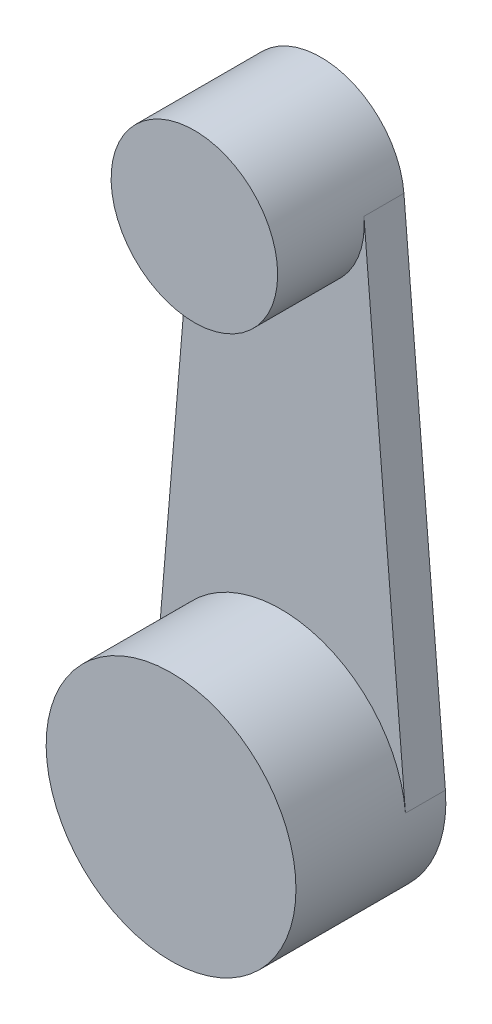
from build123d import *

# Parameters (mm, degrees)
SKETCH2_R      = 25
EXTRUDE3_DEPTH = 38
SKETCH2_3_R    = 37.5
EXTRUDE4_DEPTH = 45
EXTRUDE5_DEPTH = 12


with BuildPart() as part:
    # Sketch2 → Extrude3 (new body)
    with BuildSketch(Plane.XY):
        with Locations((0, 150)):
            Circle(SKETCH2_R)
    extrude(amount=EXTRUDE3_DEPTH)



with BuildPart() as body_2:
    # Sketch2_3 → Extrude4 (new body)
    with BuildSketch(Plane.XY):
        with Locations(Location((0, 0, 0), (0, 0, 180))):
            Circle(SKETCH2_3_R)
    extrude(amount=EXTRUDE4_DEPTH)


with BuildPart() as part_1:
    add(part.part)

    add(body_2.part)  # Extrude5 merges body 2
    # Sketch2_4 → Extrude5 (add)
    with BuildSketch(Plane.XY):
        with BuildLine():
            Line((37.369564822, 3.125), (24.913043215, 152.083333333))
            ThreePointArc((24.913043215, 152.083333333), (24.978251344, 151.04257365), (25, 150))
            ThreePointArc((25, 150), (-1.04257365, 125.021748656), (-24.913043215, 152.083333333))
            Line((-24.913043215, 152.083333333), (-37.369564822, 3.125))
            ThreePointArc((-37.369564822, 3.125), (0, 37.5), (37.369564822, 3.125))
        make_face()
    extrude(amount=EXTRUDE5_DEPTH)


solid = part_1.part
